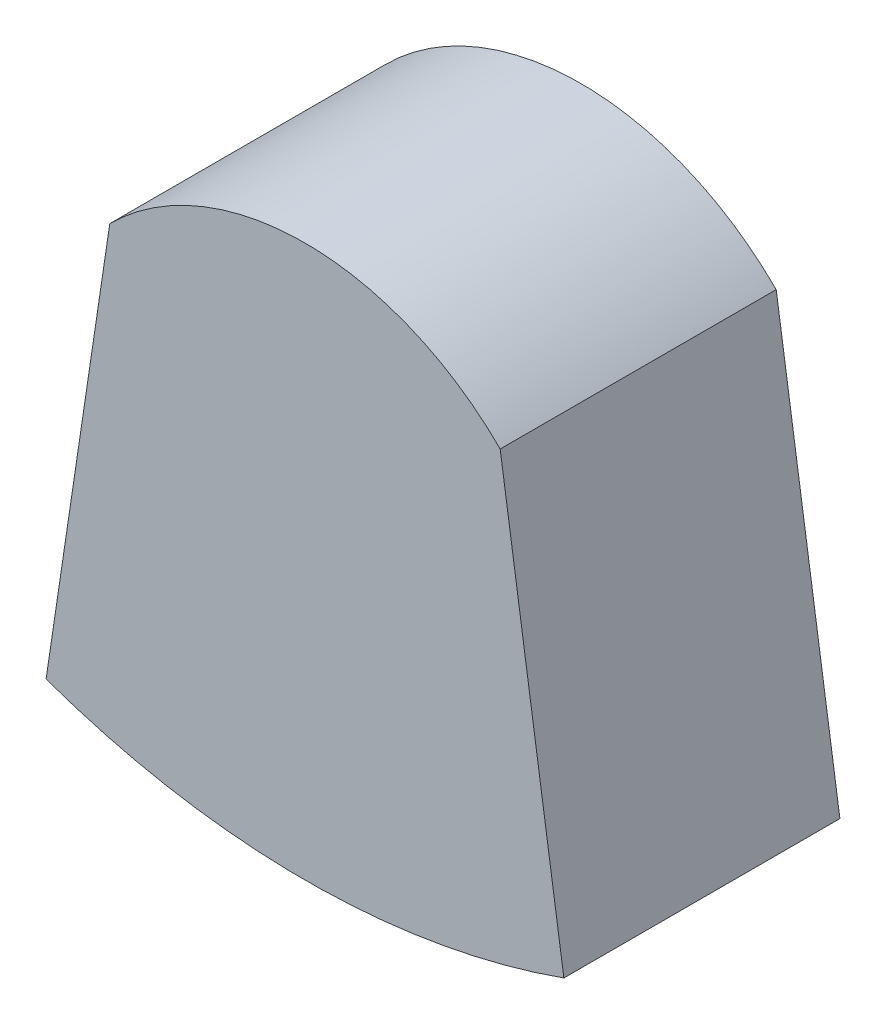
ISO-10303-21;
HEADER;
FILE_DESCRIPTION(('STEP AP214'),'2;1');
FILE_NAME('part.step','',(''),(''),'','','');
FILE_SCHEMA(('AUTOMOTIVE_DESIGN { 1 0 10303 214 1 1 1 1 }'));
ENDSEC;
DATA;
#1=APPLICATION_CONTEXT('core data for automotive mechanical design processes');
#2=APPLICATION_PROTOCOL_DEFINITION('international standard','automotive_design',2000,#1);
#3=PRODUCT_CONTEXT('',#1,'mechanical');
#4=PRODUCT('Part','Part','',(#3));
#5=PRODUCT_RELATED_PRODUCT_CATEGORY('part','',(#4));
#6=PRODUCT_DEFINITION_FORMATION('','',#4);
#7=PRODUCT_DEFINITION_CONTEXT('part definition',#1,'design');
#8=PRODUCT_DEFINITION('design','',#6,#7);
#9=PRODUCT_DEFINITION_SHAPE('','',#8);
#10=(LENGTH_UNIT() NAMED_UNIT(*) SI_UNIT(.MILLI.,.METRE.));
#11=(NAMED_UNIT(*) PLANE_ANGLE_UNIT() SI_UNIT($,.RADIAN.));
#12=(NAMED_UNIT(*) SI_UNIT($,.STERADIAN.) SOLID_ANGLE_UNIT());
#13=UNCERTAINTY_MEASURE_WITH_UNIT(LENGTH_MEASURE(1.E-05),#10,'distance_accuracy_value','');
#14=(GEOMETRIC_REPRESENTATION_CONTEXT(3) GLOBAL_UNCERTAINTY_ASSIGNED_CONTEXT((#13)) GLOBAL_UNIT_ASSIGNED_CONTEXT((#10,
#11,#12)) REPRESENTATION_CONTEXT('',''));
#15=CARTESIAN_POINT('',(0.,0.,0.));
#16=DIRECTION('',(0.,0.,1.));
#17=DIRECTION('',(1.,0.,0.));
#18=AXIS2_PLACEMENT_3D('',#15,#16,#17);
#19=CARTESIAN_POINT('',(0.,-1.91543122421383,2.54));
#20=DIRECTION('',(0.,0.,-1.));
#21=DIRECTION('',(-1.,0.,0.));
#22=AXIS2_PLACEMENT_3D('',#19,#20,#21);
#23=CYLINDRICAL_SURFACE('',#22,2.54);
#24=CARTESIAN_POINT('',(0.,-1.91543122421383,0.));
#25=DIRECTION('',(0.,0.,1.));
#26=DIRECTION('',(-1.,0.,0.));
#27=AXIS2_PLACEMENT_3D('',#24,#25,#26);
#28=CIRCLE('',#27,2.54);
#29=CARTESIAN_POINT('',(1.79605122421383,-0.11938,0.));
#30=VERTEX_POINT('',#29);
#31=CARTESIAN_POINT('',(-1.79605122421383,-0.11938,0.));
#32=VERTEX_POINT('',#31);
#33=EDGE_CURVE('E98',#30,#32,#28,.T.);
#34=ORIENTED_EDGE('',*,*,#33,.T.);
#35=DIRECTION('',(0.,0.,-1.));
#36=VECTOR('',#35,1.);
#37=CARTESIAN_POINT('',(-1.79605122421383,-0.11938,2.54));
#38=LINE('',#37,#36);
#39=CARTESIAN_POINT('',(-1.79605122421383,-0.11938,2.54));
#40=VERTEX_POINT('',#39);
#41=EDGE_CURVE('E11',#40,#32,#38,.T.);
#42=ORIENTED_EDGE('',*,*,#41,.F.);
#43=CARTESIAN_POINT('',(0.,-1.91543122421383,2.54));
#44=DIRECTION('',(0.,0.,1.));
#45=DIRECTION('',(-1.,0.,0.));
#46=AXIS2_PLACEMENT_3D('',#43,#44,#45);
#47=CIRCLE('',#46,2.54);
#48=CARTESIAN_POINT('',(1.79605122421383,-0.11938,2.54));
#49=VERTEX_POINT('',#48);
#50=EDGE_CURVE('E86',#49,#40,#47,.T.);
#51=ORIENTED_EDGE('',*,*,#50,.F.);
#52=DIRECTION('',(0.,0.,-1.));
#53=VECTOR('',#52,1.);
#54=CARTESIAN_POINT('',(1.79605122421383,-0.11938,2.54));
#55=LINE('',#54,#53);
#56=EDGE_CURVE('E94',#49,#30,#55,.T.);
#57=ORIENTED_EDGE('',*,*,#56,.T.);
#58=EDGE_LOOP('',(#34,#42,#51,#57));
#59=FACE_BOUND('',#58,.T.);
#60=ADVANCED_FACE('F35',(#59),#23,.T.);
#61=CARTESIAN_POINT('',(-1.79605122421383,-0.11938,2.54));
#62=DIRECTION('',(0.989019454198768,-0.147785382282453,0.));
#63=DIRECTION('',(0.147785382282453,0.989019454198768,0.));
#64=AXIS2_PLACEMENT_3D('',#61,#62,#63);
#65=PLANE('',#64);
#66=DIRECTION('',(-0.147785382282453,-0.989019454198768,0.));
#67=VECTOR('',#66,1.);
#68=CARTESIAN_POINT('',(-1.79605122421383,-0.11938,0.));
#69=LINE('',#68,#67);
#70=CARTESIAN_POINT('',(-2.38216520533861,-4.04181211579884,0.));
#71=VERTEX_POINT('',#70);
#72=EDGE_CURVE('E90',#32,#71,#69,.T.);
#73=ORIENTED_EDGE('',*,*,#72,.T.);
#74=DIRECTION('',(0.,0.,-1.));
#75=VECTOR('',#74,1.);
#76=CARTESIAN_POINT('',(-2.38216520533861,-4.04181211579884,2.54));
#77=LINE('',#76,#75);
#78=CARTESIAN_POINT('',(-2.38216520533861,-4.04181211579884,2.54));
#79=VERTEX_POINT('',#78);
#80=EDGE_CURVE('E43',#79,#71,#77,.T.);
#81=ORIENTED_EDGE('',*,*,#80,.F.);
#82=DIRECTION('',(-0.147785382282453,-0.989019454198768,0.));
#83=VECTOR('',#82,1.);
#84=CARTESIAN_POINT('',(-1.79605122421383,-0.11938,2.54));
#85=LINE('',#84,#83);
#86=EDGE_CURVE('E81',#40,#79,#85,.T.);
#87=ORIENTED_EDGE('',*,*,#86,.F.);
#88=ORIENTED_EDGE('',*,*,#41,.T.);
#89=EDGE_LOOP('',(#73,#81,#87,#88));
#90=FACE_BOUND('',#89,.T.);
#91=ADVANCED_FACE('F89',(#90),#65,.F.);
#92=CARTESIAN_POINT('',(0.,2.65936934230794,2.54));
#93=DIRECTION('',(0.,0.,-1.));
#94=DIRECTION('',(-1.,0.,0.));
#95=AXIS2_PLACEMENT_3D('',#92,#93,#94);
#96=CYLINDRICAL_SURFACE('',#95,7.112);
#97=CARTESIAN_POINT('',(0.,2.65936934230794,0.));
#98=DIRECTION('',(0.,0.,1.));
#99=DIRECTION('',(1.,0.,0.));
#100=AXIS2_PLACEMENT_3D('',#97,#98,#99);
#101=CIRCLE('',#100,7.112);
#102=CARTESIAN_POINT('',(2.38216520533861,-4.04181211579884,0.));
#103=VERTEX_POINT('',#102);
#104=EDGE_CURVE('E68',#71,#103,#101,.T.);
#105=ORIENTED_EDGE('',*,*,#104,.T.);
#106=DIRECTION('',(0.,0.,-1.));
#107=VECTOR('',#106,1.);
#108=CARTESIAN_POINT('',(2.38216520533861,-4.04181211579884,2.54));
#109=LINE('',#108,#107);
#110=CARTESIAN_POINT('',(2.38216520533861,-4.04181211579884,2.54));
#111=VERTEX_POINT('',#110);
#112=EDGE_CURVE('E91',#111,#103,#109,.T.);
#113=ORIENTED_EDGE('',*,*,#112,.F.);
#114=CARTESIAN_POINT('',(0.,2.65936934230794,2.54));
#115=DIRECTION('',(0.,0.,1.));
#116=DIRECTION('',(1.,0.,0.));
#117=AXIS2_PLACEMENT_3D('',#114,#115,#116);
#118=CIRCLE('',#117,7.112);
#119=EDGE_CURVE('E84',#79,#111,#118,.T.);
#120=ORIENTED_EDGE('',*,*,#119,.F.);
#121=ORIENTED_EDGE('',*,*,#80,.T.);
#122=EDGE_LOOP('',(#105,#113,#120,#121));
#123=FACE_BOUND('',#122,.T.);
#124=ADVANCED_FACE('F92',(#123),#96,.T.);
#125=CARTESIAN_POINT('',(1.79605122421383,-0.11938,2.54));
#126=DIRECTION('',(-0.989019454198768,-0.147785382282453,0.));
#127=DIRECTION('',(0.147785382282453,-0.989019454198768,0.));
#128=AXIS2_PLACEMENT_3D('',#125,#126,#127);
#129=PLANE('',#128);
#130=DIRECTION('',(-0.147785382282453,0.989019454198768,0.));
#131=VECTOR('',#130,1.);
#132=CARTESIAN_POINT('',(1.79605122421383,-0.11938,0.));
#133=LINE('',#132,#131);
#134=EDGE_CURVE('E74',#103,#30,#133,.T.);
#135=ORIENTED_EDGE('',*,*,#134,.T.);
#136=ORIENTED_EDGE('',*,*,#56,.F.);
#137=DIRECTION('',(-0.147785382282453,0.989019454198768,0.));
#138=VECTOR('',#137,1.);
#139=CARTESIAN_POINT('',(1.79605122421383,-0.11938,2.54));
#140=LINE('',#139,#138);
#141=EDGE_CURVE('E51',#111,#49,#140,.T.);
#142=ORIENTED_EDGE('',*,*,#141,.F.);
#143=ORIENTED_EDGE('',*,*,#112,.T.);
#144=EDGE_LOOP('',(#135,#136,#142,#143));
#145=FACE_BOUND('',#144,.T.);
#146=ADVANCED_FACE('F105',(#145),#129,.F.);
#147=CARTESIAN_POINT('',(0.,-1.91543122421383,2.54));
#148=DIRECTION('',(0.,0.,-1.));
#149=DIRECTION('',(-1.,0.,0.));
#150=AXIS2_PLACEMENT_3D('',#147,#148,#149);
#151=PLANE('',#150);
#152=ORIENTED_EDGE('',*,*,#50,.T.);
#153=ORIENTED_EDGE('',*,*,#86,.T.);
#154=ORIENTED_EDGE('',*,*,#119,.T.);
#155=ORIENTED_EDGE('',*,*,#141,.T.);
#156=EDGE_LOOP('',(#152,#153,#154,#155));
#157=FACE_BOUND('',#156,.T.);
#158=ADVANCED_FACE('F82',(#157),#151,.F.);
#159=CARTESIAN_POINT('',(0.,-1.91543122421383,0.));
#160=DIRECTION('',(0.,0.,-1.));
#161=DIRECTION('',(-1.,0.,0.));
#162=AXIS2_PLACEMENT_3D('',#159,#160,#161);
#163=PLANE('',#162);
#164=ORIENTED_EDGE('',*,*,#33,.F.);
#165=ORIENTED_EDGE('',*,*,#134,.F.);
#166=ORIENTED_EDGE('',*,*,#104,.F.);
#167=ORIENTED_EDGE('',*,*,#72,.F.);
#168=EDGE_LOOP('',(#164,#165,#166,#167));
#169=FACE_BOUND('',#168,.T.);
#170=ADVANCED_FACE('F108',(#169),#163,.T.);
#171=CLOSED_SHELL('',(#60,#91,#124,#146,#158,#170));
#172=MANIFOLD_SOLID_BREP('B2',#171);
#173=ADVANCED_BREP_SHAPE_REPRESENTATION('',(#18,#172),#14);
#174=SHAPE_DEFINITION_REPRESENTATION(#9,#173);
ENDSEC;
END-ISO-10303-21;
